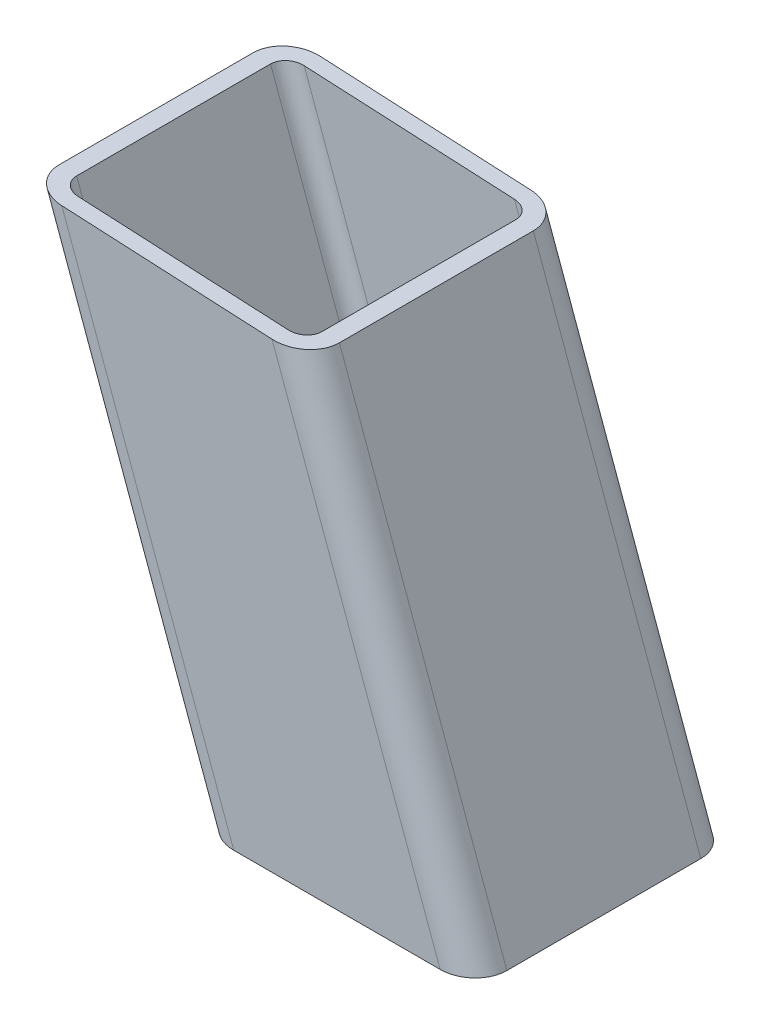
ISO-10303-21;
HEADER;
FILE_DESCRIPTION(('STEP AP214'),'2;1');
FILE_NAME('part.step','',(''),(''),'','','');
FILE_SCHEMA(('AUTOMOTIVE_DESIGN { 1 0 10303 214 1 1 1 1 }'));
ENDSEC;
DATA;
#1=APPLICATION_CONTEXT('core data for automotive mechanical design processes');
#2=APPLICATION_PROTOCOL_DEFINITION('international standard','automotive_design',2000,#1);
#3=PRODUCT_CONTEXT('',#1,'mechanical');
#4=PRODUCT('Part','Part','',(#3));
#5=PRODUCT_RELATED_PRODUCT_CATEGORY('part','',(#4));
#6=PRODUCT_DEFINITION_FORMATION('','',#4);
#7=PRODUCT_DEFINITION_CONTEXT('part definition',#1,'design');
#8=PRODUCT_DEFINITION('design','',#6,#7);
#9=PRODUCT_DEFINITION_SHAPE('','',#8);
#10=(LENGTH_UNIT() NAMED_UNIT(*) SI_UNIT(.MILLI.,.METRE.));
#11=(NAMED_UNIT(*) PLANE_ANGLE_UNIT() SI_UNIT($,.RADIAN.));
#12=(NAMED_UNIT(*) SI_UNIT($,.STERADIAN.) SOLID_ANGLE_UNIT());
#13=UNCERTAINTY_MEASURE_WITH_UNIT(LENGTH_MEASURE(1.E-05),#10,'distance_accuracy_value','');
#14=(GEOMETRIC_REPRESENTATION_CONTEXT(3) GLOBAL_UNCERTAINTY_ASSIGNED_CONTEXT((#13)) GLOBAL_UNIT_ASSIGNED_CONTEXT((#10,
#11,#12)) REPRESENTATION_CONTEXT('',''));
#15=CARTESIAN_POINT('',(0.,0.,0.));
#16=DIRECTION('',(0.,0.,1.));
#17=DIRECTION('',(1.,0.,0.));
#18=AXIS2_PLACEMENT_3D('',#15,#16,#17);
#19=CARTESIAN_POINT('',(3384.47494211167,13.6808057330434,30.));
#20=DIRECTION('',(-0.93969262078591,-0.342020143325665,0.));
#21=DIRECTION('',(0.342020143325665,-0.93969262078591,0.));
#22=AXIS2_PLACEMENT_3D('',#19,#20,#21);
#23=PLANE('',#22);
#24=DIRECTION('',(0.,0.,1.));
#25=VECTOR('',#24,1.);
#26=CARTESIAN_POINT('',(3368.7080448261,56.9999999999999,30.0000000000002));
#27=LINE('',#26,#25);
#28=CARTESIAN_POINT('',(3368.7080448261,57.,-30.));
#29=VERTEX_POINT('',#28);
#30=CARTESIAN_POINT('',(3368.7080448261,56.9999999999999,30.));
#31=VERTEX_POINT('',#30);
#32=EDGE_CURVE('E53',#29,#31,#27,.T.);
#33=ORIENTED_EDGE('',*,*,#32,.F.);
#34=DIRECTION('',(-0.342020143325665,0.93969262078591,0.));
#35=VECTOR('',#34,1.);
#36=CARTESIAN_POINT('',(3384.47494211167,13.6808057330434,-30.));
#37=LINE('',#36,#35);
#38=CARTESIAN_POINT('',(3316.90950994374,199.315304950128,-30.));
#39=VERTEX_POINT('',#38);
#40=EDGE_CURVE('E38',#29,#39,#37,.T.);
#41=ORIENTED_EDGE('',*,*,#40,.T.);
#42=DIRECTION('',(0.,0.,-1.));
#43=VECTOR('',#42,1.);
#44=CARTESIAN_POINT('',(3316.90950994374,199.315304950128,30.));
#45=LINE('',#44,#43);
#46=CARTESIAN_POINT('',(3316.90950994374,199.315304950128,30.));
#47=VERTEX_POINT('',#46);
#48=EDGE_CURVE('E107',#47,#39,#45,.T.);
#49=ORIENTED_EDGE('',*,*,#48,.F.);
#50=DIRECTION('',(-0.342020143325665,0.93969262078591,0.));
#51=VECTOR('',#50,1.);
#52=CARTESIAN_POINT('',(3384.47494211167,13.6808057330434,30.));
#53=LINE('',#52,#51);
#54=EDGE_CURVE('E185',#31,#47,#53,.T.);
#55=ORIENTED_EDGE('',*,*,#54,.F.);
#56=EDGE_LOOP('',(#33,#41,#49,#55));
#57=FACE_BOUND('',#56,.T.);
#58=ADVANCED_FACE('F34',(#57),#23,.F.);
#59=CARTESIAN_POINT('',(3375.07801590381,10.2606042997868,-30.));
#60=DIRECTION('',(-0.342020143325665,0.93969262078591,0.));
#61=DIRECTION('',(-0.93969262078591,-0.342020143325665,0.));
#62=AXIS2_PLACEMENT_3D('',#59,#60,#61);
#63=CYLINDRICAL_SURFACE('',#62,10.);
#64=CARTESIAN_POINT('',(3358.06626710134,57.0000000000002,-30.));
#65=DIRECTION('',(0.,-1.,0.));
#66=DIRECTION('',(-1.,0.,0.));
#67=AXIS2_PLACEMENT_3D('',#64,#65,#66);
#68=ELLIPSE('',#67,10.6417777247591,10.);
#69=CARTESIAN_POINT('',(3358.06626710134,57.0000000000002,-40.));
#70=VERTEX_POINT('',#69);
#71=EDGE_CURVE('E155',#70,#29,#68,.T.);
#72=ORIENTED_EDGE('',*,*,#71,.F.);
#73=DIRECTION('',(-0.342020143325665,0.93969262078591,0.));
#74=VECTOR('',#73,1.);
#75=CARTESIAN_POINT('',(3375.07801590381,10.2606042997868,-40.));
#76=LINE('',#75,#74);
#77=CARTESIAN_POINT('',(3306.07020346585,199.858010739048,-40.));
#78=VERTEX_POINT('',#77);
#79=EDGE_CURVE('E165',#70,#78,#76,.T.);
#80=ORIENTED_EDGE('',*,*,#79,.T.);
#81=CARTESIAN_POINT('',(3306.07020346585,199.858010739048,-30.));
#82=DIRECTION('',(0.0500056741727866,0.998748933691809,0.));
#83=DIRECTION('',(-0.998748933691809,0.0500056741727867,0.));
#84=AXIS2_PLACEMENT_3D('',#81,#82,#83);
#85=ELLIPSE('',#84,10.8528841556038,10.);
#86=EDGE_CURVE('E102',#39,#78,#85,.T.);
#87=ORIENTED_EDGE('',*,*,#86,.F.);
#88=ORIENTED_EDGE('',*,*,#40,.F.);
#89=EDGE_LOOP('',(#72,#80,#87,#88));
#90=FACE_BOUND('',#89,.T.);
#91=ADVANCED_FACE('F164',(#90),#63,.T.);
#92=CARTESIAN_POINT('',(3318.69645865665,-10.2606042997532,-40.));
#93=DIRECTION('',(0.,0.,1.));
#94=DIRECTION('',(1.,0.,0.));
#95=AXIS2_PLACEMENT_3D('',#92,#93,#94);
#96=PLANE('',#95);
#97=DIRECTION('',(1.,0.,0.));
#98=VECTOR('',#97,1.);
#99=CARTESIAN_POINT('',(3318.69645865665,57.0000000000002,-40.));
#100=LINE('',#99,#98);
#101=CARTESIAN_POINT('',(3294.21560075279,57.0000000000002,-40.));
#102=VERTEX_POINT('',#101);
#103=EDGE_CURVE('E152',#102,#70,#100,.T.);
#104=ORIENTED_EDGE('',*,*,#103,.F.);
#105=DIRECTION('',(-0.342020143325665,0.93969262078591,0.));
#106=VECTOR('',#105,1.);
#107=CARTESIAN_POINT('',(3318.69645865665,-10.2606042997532,-40.));
#108=LINE('',#107,#106);
#109=CARTESIAN_POINT('',(3241.03436459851,203.114245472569,-40.));
#110=VERTEX_POINT('',#109);
#111=EDGE_CURVE('E170',#102,#110,#108,.T.);
#112=ORIENTED_EDGE('',*,*,#111,.T.);
#113=DIRECTION('',(-0.998748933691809,0.0500056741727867,0.));
#114=VECTOR('',#113,1.);
#115=CARTESIAN_POINT('',(3329.1588637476,198.702000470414,-40.));
#116=LINE('',#115,#114);
#117=EDGE_CURVE('E169',#78,#110,#116,.T.);
#118=ORIENTED_EDGE('',*,*,#117,.F.);
#119=ORIENTED_EDGE('',*,*,#79,.F.);
#120=EDGE_LOOP('',(#104,#112,#118,#119));
#121=FACE_BOUND('',#120,.T.);
#122=ADVANCED_FACE('F168',(#121),#96,.F.);
#123=CARTESIAN_POINT('',(3318.69645865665,-10.2606042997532,-30.));
#124=DIRECTION('',(-0.342020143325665,0.93969262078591,0.));
#125=DIRECTION('',(-0.93969262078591,-0.342020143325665,0.));
#126=AXIS2_PLACEMENT_3D('',#123,#124,#125);
#127=CYLINDRICAL_SURFACE('',#126,10.);
#128=CARTESIAN_POINT('',(3294.21560075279,57.0000000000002,-30.));
#129=DIRECTION('',(0.,-1.,0.));
#130=DIRECTION('',(-1.,0.,0.));
#131=AXIS2_PLACEMENT_3D('',#128,#129,#130);
#132=ELLIPSE('',#131,10.6417777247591,10.);
#133=CARTESIAN_POINT('',(3283.57382302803,57.0000000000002,-30.));
#134=VERTEX_POINT('',#133);
#135=EDGE_CURVE('E150',#134,#102,#132,.T.);
#136=ORIENTED_EDGE('',*,*,#135,.F.);
#137=DIRECTION('',(-0.342020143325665,0.93969262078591,0.));
#138=VECTOR('',#137,1.);
#139=CARTESIAN_POINT('',(3309.29953244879,-13.6808057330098,-30.));
#140=LINE('',#139,#138);
#141=CARTESIAN_POINT('',(3230.19505812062,203.656951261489,-30.));
#142=VERTEX_POINT('',#141);
#143=EDGE_CURVE('E171',#134,#142,#140,.T.);
#144=ORIENTED_EDGE('',*,*,#143,.T.);
#145=CARTESIAN_POINT('',(3241.03436459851,203.114245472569,-30.));
#146=DIRECTION('',(0.0500056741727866,0.998748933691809,0.));
#147=DIRECTION('',(-0.998748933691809,0.0500056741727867,0.));
#148=AXIS2_PLACEMENT_3D('',#145,#146,#147);
#149=ELLIPSE('',#148,10.8528841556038,10.);
#150=EDGE_CURVE('E228',#110,#142,#149,.T.);
#151=ORIENTED_EDGE('',*,*,#150,.F.);
#152=ORIENTED_EDGE('',*,*,#111,.F.);
#153=EDGE_LOOP('',(#136,#144,#151,#152));
#154=FACE_BOUND('',#153,.T.);
#155=ADVANCED_FACE('F325',(#154),#127,.T.);
#156=CARTESIAN_POINT('',(3309.29953244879,-13.6808057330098,-30.));
#157=DIRECTION('',(0.93969262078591,0.342020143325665,0.));
#158=DIRECTION('',(-0.342020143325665,0.93969262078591,0.));
#159=AXIS2_PLACEMENT_3D('',#156,#157,#158);
#160=PLANE('',#159);
#161=DIRECTION('',(0.,0.,-1.));
#162=VECTOR('',#161,1.);
#163=CARTESIAN_POINT('',(3283.57382302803,57.0000000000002,-29.9999999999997));
#164=LINE('',#163,#162);
#165=CARTESIAN_POINT('',(3283.57382302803,56.9999999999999,30.));
#166=VERTEX_POINT('',#165);
#167=EDGE_CURVE('E253',#166,#134,#164,.T.);
#168=ORIENTED_EDGE('',*,*,#167,.F.);
#169=DIRECTION('',(-0.342020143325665,0.93969262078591,0.));
#170=VECTOR('',#169,1.);
#171=CARTESIAN_POINT('',(3309.29953244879,-13.6808057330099,30.));
#172=LINE('',#171,#170);
#173=CARTESIAN_POINT('',(3230.19505812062,203.656951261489,30.));
#174=VERTEX_POINT('',#173);
#175=EDGE_CURVE('E176',#166,#174,#172,.T.);
#176=ORIENTED_EDGE('',*,*,#175,.T.);
#177=DIRECTION('',(0.,0.,1.));
#178=VECTOR('',#177,1.);
#179=CARTESIAN_POINT('',(3230.19505812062,203.656951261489,-30.0000000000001));
#180=LINE('',#179,#178);
#181=EDGE_CURVE('E230',#142,#174,#180,.T.);
#182=ORIENTED_EDGE('',*,*,#181,.F.);
#183=ORIENTED_EDGE('',*,*,#143,.F.);
#184=EDGE_LOOP('',(#168,#176,#182,#183));
#185=FACE_BOUND('',#184,.T.);
#186=ADVANCED_FACE('F328',(#185),#160,.F.);
#187=CARTESIAN_POINT('',(3318.69645865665,-10.2606042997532,30.));
#188=DIRECTION('',(-0.342020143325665,0.93969262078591,0.));
#189=DIRECTION('',(-0.93969262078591,-0.342020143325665,0.));
#190=AXIS2_PLACEMENT_3D('',#187,#188,#189);
#191=CYLINDRICAL_SURFACE('',#190,10.);
#192=CARTESIAN_POINT('',(3294.21560075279,56.9999999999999,30.));
#193=DIRECTION('',(0.,-1.,0.));
#194=DIRECTION('',(-1.,0.,0.));
#195=AXIS2_PLACEMENT_3D('',#192,#193,#194);
#196=ELLIPSE('',#195,10.6417777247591,10.);
#197=CARTESIAN_POINT('',(3294.21560075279,56.9999999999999,40.));
#198=VERTEX_POINT('',#197);
#199=EDGE_CURVE('E255',#198,#166,#196,.T.);
#200=ORIENTED_EDGE('',*,*,#199,.F.);
#201=DIRECTION('',(-0.342020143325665,0.93969262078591,0.));
#202=VECTOR('',#201,1.);
#203=CARTESIAN_POINT('',(3318.69645865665,-10.2606042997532,40.));
#204=LINE('',#203,#202);
#205=CARTESIAN_POINT('',(3241.03436459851,203.114245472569,40.));
#206=VERTEX_POINT('',#205);
#207=EDGE_CURVE('E179',#198,#206,#204,.T.);
#208=ORIENTED_EDGE('',*,*,#207,.T.);
#209=CARTESIAN_POINT('',(3241.03436459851,203.114245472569,30.));
#210=DIRECTION('',(0.0500056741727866,0.998748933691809,0.));
#211=DIRECTION('',(-0.998748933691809,0.0500056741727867,0.));
#212=AXIS2_PLACEMENT_3D('',#209,#210,#211);
#213=ELLIPSE('',#212,10.8528841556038,10.);
#214=EDGE_CURVE('E232',#174,#206,#213,.T.);
#215=ORIENTED_EDGE('',*,*,#214,.F.);
#216=ORIENTED_EDGE('',*,*,#175,.F.);
#217=EDGE_LOOP('',(#200,#208,#215,#216));
#218=FACE_BOUND('',#217,.T.);
#219=ADVANCED_FACE('F332',(#218),#191,.T.);
#220=CARTESIAN_POINT('',(3375.07801590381,10.2606042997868,40.));
#221=DIRECTION('',(0.,0.,-1.));
#222=DIRECTION('',(-1.,0.,0.));
#223=AXIS2_PLACEMENT_3D('',#220,#221,#222);
#224=PLANE('',#223);
#225=DIRECTION('',(-1.,0.,0.));
#226=VECTOR('',#225,1.);
#227=CARTESIAN_POINT('',(3375.07801590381,56.9999999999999,40.));
#228=LINE('',#227,#226);
#229=CARTESIAN_POINT('',(3358.06626710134,56.9999999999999,40.));
#230=VERTEX_POINT('',#229);
#231=EDGE_CURVE('E257',#230,#198,#228,.T.);
#232=ORIENTED_EDGE('',*,*,#231,.F.);
#233=DIRECTION('',(-0.342020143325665,0.93969262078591,0.));
#234=VECTOR('',#233,1.);
#235=CARTESIAN_POINT('',(3375.07801590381,10.2606042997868,40.));
#236=LINE('',#235,#234);
#237=CARTESIAN_POINT('',(3306.07020346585,199.858010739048,40.));
#238=VERTEX_POINT('',#237);
#239=EDGE_CURVE('E182',#230,#238,#236,.T.);
#240=ORIENTED_EDGE('',*,*,#239,.T.);
#241=DIRECTION('',(0.998748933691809,-0.0500056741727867,0.));
#242=VECTOR('',#241,1.);
#243=CARTESIAN_POINT('',(3384.3745420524,195.937444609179,40.));
#244=LINE('',#243,#242);
#245=EDGE_CURVE('E234',#206,#238,#244,.T.);
#246=ORIENTED_EDGE('',*,*,#245,.F.);
#247=ORIENTED_EDGE('',*,*,#207,.F.);
#248=EDGE_LOOP('',(#232,#240,#246,#247));
#249=FACE_BOUND('',#248,.T.);
#250=ADVANCED_FACE('F335',(#249),#224,.F.);
#251=CARTESIAN_POINT('',(3375.07801590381,10.2606042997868,30.));
#252=DIRECTION('',(-0.342020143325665,0.93969262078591,0.));
#253=DIRECTION('',(-0.93969262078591,-0.342020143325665,0.));
#254=AXIS2_PLACEMENT_3D('',#251,#252,#253);
#255=CYLINDRICAL_SURFACE('',#254,10.);
#256=CARTESIAN_POINT('',(3358.06626710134,56.9999999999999,30.));
#257=DIRECTION('',(0.,-1.,0.));
#258=DIRECTION('',(-1.,0.,0.));
#259=AXIS2_PLACEMENT_3D('',#256,#257,#258);
#260=ELLIPSE('',#259,10.6417777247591,10.);
#261=EDGE_CURVE('E236',#31,#230,#260,.T.);
#262=ORIENTED_EDGE('',*,*,#261,.F.);
#263=ORIENTED_EDGE('',*,*,#54,.T.);
#264=CARTESIAN_POINT('',(3306.07020346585,199.858010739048,30.));
#265=DIRECTION('',(0.0500056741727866,0.998748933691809,0.));
#266=DIRECTION('',(-0.998748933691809,0.0500056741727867,0.));
#267=AXIS2_PLACEMENT_3D('',#264,#265,#266);
#268=ELLIPSE('',#267,10.8528841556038,10.);
#269=EDGE_CURVE('E110',#238,#47,#268,.T.);
#270=ORIENTED_EDGE('',*,*,#269,.F.);
#271=ORIENTED_EDGE('',*,*,#239,.F.);
#272=EDGE_LOOP('',(#262,#263,#270,#271));
#273=FACE_BOUND('',#272,.T.);
#274=ADVANCED_FACE('F36',(#273),#255,.T.);
#275=CARTESIAN_POINT('',(6158.08276398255,57.0625533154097,-40.));
#276=DIRECTION('',(0.0500056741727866,0.998748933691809,0.));
#277=DIRECTION('',(-0.998748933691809,0.0500056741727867,0.));
#278=AXIS2_PLACEMENT_3D('',#275,#276,#277);
#279=PLANE('',#278);
#280=DIRECTION('',(0.,0.,1.));
#281=VECTOR('',#280,1.);
#282=CARTESIAN_POINT('',(3235.61471135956,203.385598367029,-30.));
#283=LINE('',#282,#281);
#284=CARTESIAN_POINT('',(3235.61471135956,203.385598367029,-30.));
#285=VERTEX_POINT('',#284);
#286=CARTESIAN_POINT('',(3235.61471135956,203.385598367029,30.));
#287=VERTEX_POINT('',#286);
#288=EDGE_CURVE('E191',#285,#287,#283,.T.);
#289=ORIENTED_EDGE('',*,*,#288,.F.);
#290=CARTESIAN_POINT('',(3241.03436459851,203.114245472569,-30.));
#291=DIRECTION('',(0.0500056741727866,0.998748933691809,0.));
#292=DIRECTION('',(-0.998748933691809,0.0500056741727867,0.));
#293=AXIS2_PLACEMENT_3D('',#290,#291,#292);
#294=ELLIPSE('',#293,5.4264420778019,5.00000000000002);
#295=CARTESIAN_POINT('',(3241.03436459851,203.114245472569,-35.));
#296=VERTEX_POINT('',#295);
#297=EDGE_CURVE('E196',#296,#285,#294,.T.);
#298=ORIENTED_EDGE('',*,*,#297,.F.);
#299=DIRECTION('',(-0.998748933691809,0.0500056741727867,0.));
#300=VECTOR('',#299,1.);
#301=CARTESIAN_POINT('',(3329.1588637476,198.702000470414,-35.));
#302=LINE('',#301,#300);
#303=CARTESIAN_POINT('',(3306.07020346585,199.858010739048,-35.));
#304=VERTEX_POINT('',#303);
#305=EDGE_CURVE('E201',#304,#296,#302,.T.);
#306=ORIENTED_EDGE('',*,*,#305,.F.);
#307=CARTESIAN_POINT('',(3306.07020346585,199.858010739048,-30.));
#308=DIRECTION('',(0.0500056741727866,0.998748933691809,0.));
#309=DIRECTION('',(-0.998748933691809,0.0500056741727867,0.));
#310=AXIS2_PLACEMENT_3D('',#307,#308,#309);
#311=ELLIPSE('',#310,5.42644207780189,5.00000000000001);
#312=CARTESIAN_POINT('',(3311.48985670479,199.586657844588,-30.));
#313=VERTEX_POINT('',#312);
#314=EDGE_CURVE('E206',#313,#304,#311,.T.);
#315=ORIENTED_EDGE('',*,*,#314,.F.);
#316=DIRECTION('',(0.,0.,-1.));
#317=VECTOR('',#316,1.);
#318=CARTESIAN_POINT('',(3311.48985670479,199.586657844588,30.));
#319=LINE('',#318,#317);
#320=CARTESIAN_POINT('',(3311.48985670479,199.586657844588,30.));
#321=VERTEX_POINT('',#320);
#322=EDGE_CURVE('E211',#321,#313,#319,.T.);
#323=ORIENTED_EDGE('',*,*,#322,.F.);
#324=CARTESIAN_POINT('',(3306.07020346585,199.858010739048,30.));
#325=DIRECTION('',(0.0500056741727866,0.998748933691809,0.));
#326=DIRECTION('',(-0.998748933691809,0.0500056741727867,0.));
#327=AXIS2_PLACEMENT_3D('',#324,#325,#326);
#328=ELLIPSE('',#327,5.42644207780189,5.00000000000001);
#329=CARTESIAN_POINT('',(3306.07020346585,199.858010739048,35.));
#330=VERTEX_POINT('',#329);
#331=EDGE_CURVE('E216',#330,#321,#328,.T.);
#332=ORIENTED_EDGE('',*,*,#331,.F.);
#333=DIRECTION('',(0.998748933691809,-0.0500056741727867,0.));
#334=VECTOR('',#333,1.);
#335=CARTESIAN_POINT('',(3384.3745420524,195.937444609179,35.));
#336=LINE('',#335,#334);
#337=CARTESIAN_POINT('',(3241.03436459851,203.114245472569,35.));
#338=VERTEX_POINT('',#337);
#339=EDGE_CURVE('E221',#338,#330,#336,.T.);
#340=ORIENTED_EDGE('',*,*,#339,.F.);
#341=CARTESIAN_POINT('',(3241.03436459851,203.114245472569,30.));
#342=DIRECTION('',(0.0500056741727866,0.998748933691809,0.));
#343=DIRECTION('',(-0.998748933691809,0.0500056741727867,0.));
#344=AXIS2_PLACEMENT_3D('',#341,#342,#343);
#345=ELLIPSE('',#344,5.42644207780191,5.00000000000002);
#346=EDGE_CURVE('E11',#287,#338,#345,.T.);
#347=ORIENTED_EDGE('',*,*,#346,.F.);
#348=EDGE_LOOP('',(#289,#298,#306,#315,#323,#332,#340,#347));
#349=FACE_BOUND('',#348,.T.);
#350=ORIENTED_EDGE('',*,*,#269,.T.);
#351=ORIENTED_EDGE('',*,*,#48,.T.);
#352=ORIENTED_EDGE('',*,*,#86,.T.);
#353=ORIENTED_EDGE('',*,*,#117,.T.);
#354=ORIENTED_EDGE('',*,*,#150,.T.);
#355=ORIENTED_EDGE('',*,*,#181,.T.);
#356=ORIENTED_EDGE('',*,*,#214,.T.);
#357=ORIENTED_EDGE('',*,*,#245,.T.);
#358=EDGE_LOOP('',(#350,#351,#352,#353,#354,#355,#356,#357));
#359=FACE_BOUND('',#358,.T.);
#360=ADVANCED_FACE('F286',(#349,#359),#279,.T.);
#361=CARTESIAN_POINT('',(9149.96897120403,57.0000000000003,-59.9999999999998));
#362=DIRECTION('',(0.,-1.,0.));
#363=DIRECTION('',(0.,0.,-1.));
#364=AXIS2_PLACEMENT_3D('',#361,#362,#363);
#365=PLANE('',#364);
#366=DIRECTION('',(-1.,0.,0.));
#367=VECTOR('',#366,1.);
#368=CARTESIAN_POINT('',(3375.07801590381,56.9999999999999,35.));
#369=LINE('',#368,#367);
#370=CARTESIAN_POINT('',(3358.06626710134,56.9999999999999,35.));
#371=VERTEX_POINT('',#370);
#372=CARTESIAN_POINT('',(3294.21560075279,56.9999999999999,35.));
#373=VERTEX_POINT('',#372);
#374=EDGE_CURVE('E222',#371,#373,#369,.T.);
#375=ORIENTED_EDGE('',*,*,#374,.F.);
#376=CARTESIAN_POINT('',(3358.06626710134,56.9999999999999,30.));
#377=DIRECTION('',(0.,-1.,0.));
#378=DIRECTION('',(-1.,0.,0.));
#379=AXIS2_PLACEMENT_3D('',#376,#377,#378);
#380=ELLIPSE('',#379,5.32088886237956,5.00000000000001);
#381=CARTESIAN_POINT('',(3363.38715596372,56.9999999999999,30.));
#382=VERTEX_POINT('',#381);
#383=EDGE_CURVE('E217',#382,#371,#380,.T.);
#384=ORIENTED_EDGE('',*,*,#383,.F.);
#385=DIRECTION('',(0.,0.,1.));
#386=VECTOR('',#385,1.);
#387=CARTESIAN_POINT('',(3363.38715596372,56.9999999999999,30.0000000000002));
#388=LINE('',#387,#386);
#389=CARTESIAN_POINT('',(3363.38715596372,57.0000000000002,-30.));
#390=VERTEX_POINT('',#389);
#391=EDGE_CURVE('E212',#390,#382,#388,.T.);
#392=ORIENTED_EDGE('',*,*,#391,.F.);
#393=CARTESIAN_POINT('',(3358.06626710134,57.0000000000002,-30.));
#394=DIRECTION('',(0.,-1.,0.));
#395=DIRECTION('',(-1.,0.,0.));
#396=AXIS2_PLACEMENT_3D('',#393,#394,#395);
#397=ELLIPSE('',#396,5.32088886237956,5.00000000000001);
#398=CARTESIAN_POINT('',(3358.06626710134,57.0000000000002,-35.));
#399=VERTEX_POINT('',#398);
#400=EDGE_CURVE('E207',#399,#390,#397,.T.);
#401=ORIENTED_EDGE('',*,*,#400,.F.);
#402=DIRECTION('',(1.,0.,0.));
#403=VECTOR('',#402,1.);
#404=CARTESIAN_POINT('',(3318.69645865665,57.0000000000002,-35.));
#405=LINE('',#404,#403);
#406=CARTESIAN_POINT('',(3294.21560075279,57.0000000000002,-35.));
#407=VERTEX_POINT('',#406);
#408=EDGE_CURVE('E202',#407,#399,#405,.T.);
#409=ORIENTED_EDGE('',*,*,#408,.F.);
#410=CARTESIAN_POINT('',(3294.21560075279,57.0000000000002,-30.));
#411=DIRECTION('',(0.,-1.,0.));
#412=DIRECTION('',(-1.,0.,0.));
#413=AXIS2_PLACEMENT_3D('',#410,#411,#412);
#414=ELLIPSE('',#413,5.32088886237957,5.00000000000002);
#415=CARTESIAN_POINT('',(3288.89471189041,57.0000000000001,-30.));
#416=VERTEX_POINT('',#415);
#417=EDGE_CURVE('E197',#416,#407,#414,.T.);
#418=ORIENTED_EDGE('',*,*,#417,.F.);
#419=DIRECTION('',(0.,0.,-1.));
#420=VECTOR('',#419,1.);
#421=CARTESIAN_POINT('',(3288.89471189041,57.0000000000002,-29.9999999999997));
#422=LINE('',#421,#420);
#423=CARTESIAN_POINT('',(3288.89471189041,56.9999999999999,30.));
#424=VERTEX_POINT('',#423);
#425=EDGE_CURVE('E192',#424,#416,#422,.T.);
#426=ORIENTED_EDGE('',*,*,#425,.F.);
#427=CARTESIAN_POINT('',(3294.21560075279,56.9999999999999,30.));
#428=DIRECTION('',(0.,-1.,0.));
#429=DIRECTION('',(-1.,0.,0.));
#430=AXIS2_PLACEMENT_3D('',#427,#428,#429);
#431=ELLIPSE('',#430,5.32088886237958,5.00000000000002);
#432=EDGE_CURVE('E225',#373,#424,#431,.T.);
#433=ORIENTED_EDGE('',*,*,#432,.F.);
#434=EDGE_LOOP('',(#375,#384,#392,#401,#409,#418,#426,#433));
#435=FACE_BOUND('',#434,.T.);
#436=ORIENTED_EDGE('',*,*,#261,.T.);
#437=ORIENTED_EDGE('',*,*,#231,.T.);
#438=ORIENTED_EDGE('',*,*,#199,.T.);
#439=ORIENTED_EDGE('',*,*,#167,.T.);
#440=ORIENTED_EDGE('',*,*,#135,.T.);
#441=ORIENTED_EDGE('',*,*,#103,.T.);
#442=ORIENTED_EDGE('',*,*,#71,.T.);
#443=ORIENTED_EDGE('',*,*,#32,.T.);
#444=EDGE_LOOP('',(#436,#437,#438,#439,#440,#441,#442,#443));
#445=FACE_BOUND('',#444,.T.);
#446=ADVANCED_FACE('F154',(#435,#445),#365,.T.);
#447=CARTESIAN_POINT('',(3313.99799555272,-11.9707050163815,-30.));
#448=DIRECTION('',(0.93969262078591,0.342020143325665,0.));
#449=DIRECTION('',(-0.342020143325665,0.93969262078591,0.));
#450=AXIS2_PLACEMENT_3D('',#447,#448,#449);
#451=PLANE('',#450);
#452=DIRECTION('',(-0.342020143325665,0.93969262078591,0.));
#453=VECTOR('',#452,1.);
#454=CARTESIAN_POINT('',(3313.99799555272,-11.9707050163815,30.));
#455=LINE('',#454,#453);
#456=EDGE_CURVE('E44',#424,#287,#455,.T.);
#457=ORIENTED_EDGE('',*,*,#456,.F.);
#458=ORIENTED_EDGE('',*,*,#425,.T.);
#459=DIRECTION('',(-0.342020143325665,0.93969262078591,0.));
#460=VECTOR('',#459,1.);
#461=CARTESIAN_POINT('',(3313.99799555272,-11.9707050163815,-30.));
#462=LINE('',#461,#460);
#463=EDGE_CURVE('E188',#416,#285,#462,.T.);
#464=ORIENTED_EDGE('',*,*,#463,.T.);
#465=ORIENTED_EDGE('',*,*,#288,.T.);
#466=EDGE_LOOP('',(#457,#458,#464,#465));
#467=FACE_BOUND('',#466,.T.);
#468=ADVANCED_FACE('F283',(#467),#451,.T.);
#469=CARTESIAN_POINT('',(3318.69645865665,-10.2606042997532,-30.));
#470=DIRECTION('',(-0.342020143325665,0.93969262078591,0.));
#471=DIRECTION('',(-0.93969262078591,-0.342020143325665,0.));
#472=AXIS2_PLACEMENT_3D('',#469,#470,#471);
#473=CYLINDRICAL_SURFACE('',#472,5.00000000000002);
#474=ORIENTED_EDGE('',*,*,#463,.F.);
#475=ORIENTED_EDGE('',*,*,#417,.T.);
#476=DIRECTION('',(-0.342020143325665,0.93969262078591,0.));
#477=VECTOR('',#476,1.);
#478=CARTESIAN_POINT('',(3318.69645865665,-10.2606042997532,-35.));
#479=LINE('',#478,#477);
#480=EDGE_CURVE('E193',#407,#296,#479,.T.);
#481=ORIENTED_EDGE('',*,*,#480,.T.);
#482=ORIENTED_EDGE('',*,*,#297,.T.);
#483=EDGE_LOOP('',(#474,#475,#481,#482));
#484=FACE_BOUND('',#483,.T.);
#485=ADVANCED_FACE('F288',(#484),#473,.F.);
#486=CARTESIAN_POINT('',(3318.69645865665,-10.2606042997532,-35.));
#487=DIRECTION('',(0.,0.,1.));
#488=DIRECTION('',(1.,0.,0.));
#489=AXIS2_PLACEMENT_3D('',#486,#487,#488);
#490=PLANE('',#489);
#491=ORIENTED_EDGE('',*,*,#480,.F.);
#492=ORIENTED_EDGE('',*,*,#408,.T.);
#493=DIRECTION('',(-0.342020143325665,0.93969262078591,0.));
#494=VECTOR('',#493,1.);
#495=CARTESIAN_POINT('',(3375.07801590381,10.2606042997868,-35.));
#496=LINE('',#495,#494);
#497=EDGE_CURVE('E198',#399,#304,#496,.T.);
#498=ORIENTED_EDGE('',*,*,#497,.T.);
#499=ORIENTED_EDGE('',*,*,#305,.T.);
#500=EDGE_LOOP('',(#491,#492,#498,#499));
#501=FACE_BOUND('',#500,.T.);
#502=ADVANCED_FACE('F292',(#501),#490,.T.);
#503=CARTESIAN_POINT('',(3375.07801590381,10.2606042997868,-30.));
#504=DIRECTION('',(-0.342020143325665,0.93969262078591,0.));
#505=DIRECTION('',(-0.93969262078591,-0.342020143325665,0.));
#506=AXIS2_PLACEMENT_3D('',#503,#504,#505);
#507=CYLINDRICAL_SURFACE('',#506,5.00000000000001);
#508=ORIENTED_EDGE('',*,*,#497,.F.);
#509=ORIENTED_EDGE('',*,*,#400,.T.);
#510=DIRECTION('',(-0.342020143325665,0.93969262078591,0.));
#511=VECTOR('',#510,1.);
#512=CARTESIAN_POINT('',(3379.77647900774,11.9707050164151,-30.));
#513=LINE('',#512,#511);
#514=EDGE_CURVE('E203',#390,#313,#513,.T.);
#515=ORIENTED_EDGE('',*,*,#514,.T.);
#516=ORIENTED_EDGE('',*,*,#314,.T.);
#517=EDGE_LOOP('',(#508,#509,#515,#516));
#518=FACE_BOUND('',#517,.T.);
#519=ADVANCED_FACE('F295',(#518),#507,.F.);
#520=CARTESIAN_POINT('',(3379.77647900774,11.9707050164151,30.));
#521=DIRECTION('',(-0.93969262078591,-0.342020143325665,0.));
#522=DIRECTION('',(0.342020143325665,-0.93969262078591,0.));
#523=AXIS2_PLACEMENT_3D('',#520,#521,#522);
#524=PLANE('',#523);
#525=ORIENTED_EDGE('',*,*,#514,.F.);
#526=ORIENTED_EDGE('',*,*,#391,.T.);
#527=DIRECTION('',(-0.342020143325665,0.93969262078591,0.));
#528=VECTOR('',#527,1.);
#529=CARTESIAN_POINT('',(3379.77647900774,11.9707050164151,30.));
#530=LINE('',#529,#528);
#531=EDGE_CURVE('E208',#382,#321,#530,.T.);
#532=ORIENTED_EDGE('',*,*,#531,.T.);
#533=ORIENTED_EDGE('',*,*,#322,.T.);
#534=EDGE_LOOP('',(#525,#526,#532,#533));
#535=FACE_BOUND('',#534,.T.);
#536=ADVANCED_FACE('F298',(#535),#524,.T.);
#537=CARTESIAN_POINT('',(3375.07801590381,10.2606042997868,30.));
#538=DIRECTION('',(-0.342020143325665,0.93969262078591,0.));
#539=DIRECTION('',(-0.93969262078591,-0.342020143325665,0.));
#540=AXIS2_PLACEMENT_3D('',#537,#538,#539);
#541=CYLINDRICAL_SURFACE('',#540,5.00000000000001);
#542=ORIENTED_EDGE('',*,*,#531,.F.);
#543=ORIENTED_EDGE('',*,*,#383,.T.);
#544=DIRECTION('',(-0.342020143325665,0.93969262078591,0.));
#545=VECTOR('',#544,1.);
#546=CARTESIAN_POINT('',(3375.07801590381,10.2606042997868,35.));
#547=LINE('',#546,#545);
#548=EDGE_CURVE('E213',#371,#330,#547,.T.);
#549=ORIENTED_EDGE('',*,*,#548,.T.);
#550=ORIENTED_EDGE('',*,*,#331,.T.);
#551=EDGE_LOOP('',(#542,#543,#549,#550));
#552=FACE_BOUND('',#551,.T.);
#553=ADVANCED_FACE('F301',(#552),#541,.F.);
#554=CARTESIAN_POINT('',(3375.07801590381,10.2606042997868,35.));
#555=DIRECTION('',(0.,0.,-1.));
#556=DIRECTION('',(-1.,0.,0.));
#557=AXIS2_PLACEMENT_3D('',#554,#555,#556);
#558=PLANE('',#557);
#559=ORIENTED_EDGE('',*,*,#548,.F.);
#560=ORIENTED_EDGE('',*,*,#374,.T.);
#561=DIRECTION('',(-0.342020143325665,0.93969262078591,0.));
#562=VECTOR('',#561,1.);
#563=CARTESIAN_POINT('',(3318.69645865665,-10.2606042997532,35.));
#564=LINE('',#563,#562);
#565=EDGE_CURVE('E218',#373,#338,#564,.T.);
#566=ORIENTED_EDGE('',*,*,#565,.T.);
#567=ORIENTED_EDGE('',*,*,#339,.T.);
#568=EDGE_LOOP('',(#559,#560,#566,#567));
#569=FACE_BOUND('',#568,.T.);
#570=ADVANCED_FACE('F304',(#569),#558,.T.);
#571=CARTESIAN_POINT('',(3318.69645865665,-10.2606042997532,30.));
#572=DIRECTION('',(-0.342020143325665,0.93969262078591,0.));
#573=DIRECTION('',(-0.93969262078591,-0.342020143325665,0.));
#574=AXIS2_PLACEMENT_3D('',#571,#572,#573);
#575=CYLINDRICAL_SURFACE('',#574,5.00000000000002);
#576=ORIENTED_EDGE('',*,*,#565,.F.);
#577=ORIENTED_EDGE('',*,*,#432,.T.);
#578=ORIENTED_EDGE('',*,*,#456,.T.);
#579=ORIENTED_EDGE('',*,*,#346,.T.);
#580=EDGE_LOOP('',(#576,#577,#578,#579));
#581=FACE_BOUND('',#580,.T.);
#582=ADVANCED_FACE('F280',(#581),#575,.F.);
#583=CLOSED_SHELL('',(#58,#91,#122,#155,#186,#219,#250,#274,#360,#446,#468,#485,#502,#519,#536,
#553,#570,#582));
#584=MANIFOLD_SOLID_BREP('B2',#583);
#585=ADVANCED_BREP_SHAPE_REPRESENTATION('',(#18,#584),#14);
#586=SHAPE_DEFINITION_REPRESENTATION(#9,#585);
ENDSEC;
END-ISO-10303-21;
